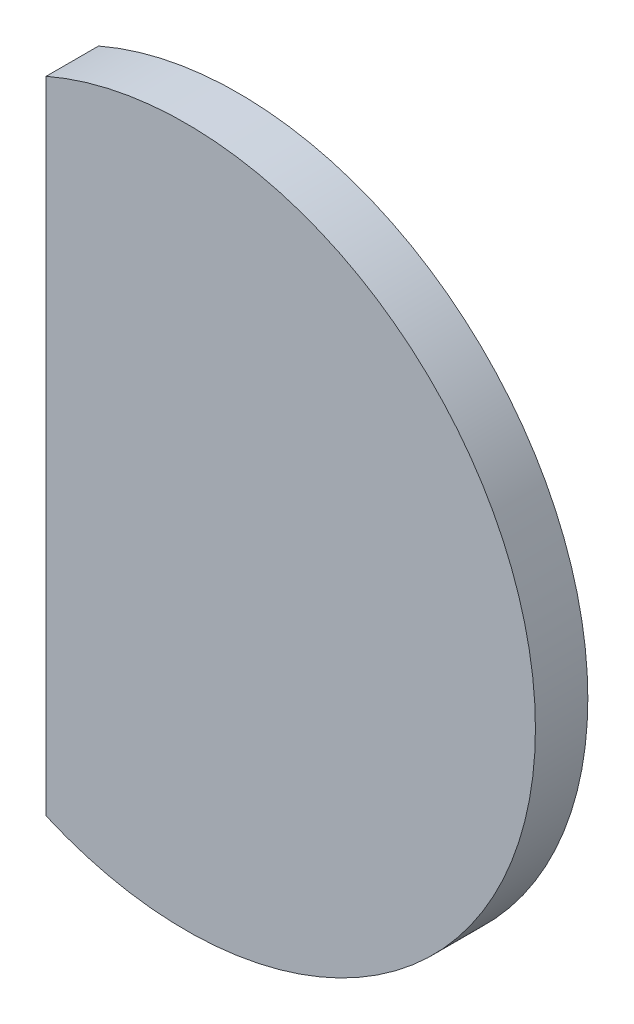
ISO-10303-21;
HEADER;
FILE_DESCRIPTION(('STEP AP214'),'2;1');
FILE_NAME('part.step','',(''),(''),'','','');
FILE_SCHEMA(('AUTOMOTIVE_DESIGN { 1 0 10303 214 1 1 1 1 }'));
ENDSEC;
DATA;
#1=APPLICATION_CONTEXT('core data for automotive mechanical design processes');
#2=APPLICATION_PROTOCOL_DEFINITION('international standard','automotive_design',2000,#1);
#3=PRODUCT_CONTEXT('',#1,'mechanical');
#4=PRODUCT('Part','Part','',(#3));
#5=PRODUCT_RELATED_PRODUCT_CATEGORY('part','',(#4));
#6=PRODUCT_DEFINITION_FORMATION('','',#4);
#7=PRODUCT_DEFINITION_CONTEXT('part definition',#1,'design');
#8=PRODUCT_DEFINITION('design','',#6,#7);
#9=PRODUCT_DEFINITION_SHAPE('','',#8);
#10=(LENGTH_UNIT() NAMED_UNIT(*) SI_UNIT(.MILLI.,.METRE.));
#11=(NAMED_UNIT(*) PLANE_ANGLE_UNIT() SI_UNIT($,.RADIAN.));
#12=(NAMED_UNIT(*) SI_UNIT($,.STERADIAN.) SOLID_ANGLE_UNIT());
#13=UNCERTAINTY_MEASURE_WITH_UNIT(LENGTH_MEASURE(1.E-05),#10,'distance_accuracy_value','');
#14=(GEOMETRIC_REPRESENTATION_CONTEXT(3) GLOBAL_UNCERTAINTY_ASSIGNED_CONTEXT((#13)) GLOBAL_UNIT_ASSIGNED_CONTEXT((#10,
#11,#12)) REPRESENTATION_CONTEXT('',''));
#15=CARTESIAN_POINT('',(0.,0.,0.));
#16=DIRECTION('',(0.,0.,1.));
#17=DIRECTION('',(1.,0.,0.));
#18=AXIS2_PLACEMENT_3D('',#15,#16,#17);
#19=CARTESIAN_POINT('',(0.,0.,15.));
#20=DIRECTION('',(0.,0.,-1.));
#21=DIRECTION('',(-1.,0.,0.));
#22=AXIS2_PLACEMENT_3D('',#19,#20,#21);
#23=CYLINDRICAL_SURFACE('',#22,100.);
#24=CARTESIAN_POINT('',(0.,0.,0.));
#25=DIRECTION('',(0.,0.,1.));
#26=DIRECTION('',(1.,0.,0.));
#27=AXIS2_PLACEMENT_3D('',#24,#25,#26);
#28=CIRCLE('',#27,100.);
#29=CARTESIAN_POINT('',(-40.,-91.6515138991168,0.));
#30=VERTEX_POINT('',#29);
#31=CARTESIAN_POINT('',(-40.,91.6515138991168,0.));
#32=VERTEX_POINT('',#31);
#33=EDGE_CURVE('E64',#30,#32,#28,.T.);
#34=ORIENTED_EDGE('',*,*,#33,.T.);
#35=DIRECTION('',(0.,0.,-1.));
#36=VECTOR('',#35,1.);
#37=CARTESIAN_POINT('',(-40.,91.6515138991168,15.));
#38=LINE('',#37,#36);
#39=CARTESIAN_POINT('',(-40.,91.6515138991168,15.));
#40=VERTEX_POINT('',#39);
#41=EDGE_CURVE('E11',#40,#32,#38,.T.);
#42=ORIENTED_EDGE('',*,*,#41,.F.);
#43=CARTESIAN_POINT('',(0.,0.,15.));
#44=DIRECTION('',(0.,0.,1.));
#45=DIRECTION('',(1.,0.,0.));
#46=AXIS2_PLACEMENT_3D('',#43,#44,#45);
#47=CIRCLE('',#46,100.);
#48=CARTESIAN_POINT('',(-40.,-91.6515138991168,15.));
#49=VERTEX_POINT('',#48);
#50=EDGE_CURVE('E63',#49,#40,#47,.T.);
#51=ORIENTED_EDGE('',*,*,#50,.F.);
#52=DIRECTION('',(0.,0.,-1.));
#53=VECTOR('',#52,1.);
#54=CARTESIAN_POINT('',(-40.,-91.6515138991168,15.));
#55=LINE('',#54,#53);
#56=EDGE_CURVE('E41',#49,#30,#55,.T.);
#57=ORIENTED_EDGE('',*,*,#56,.T.);
#58=EDGE_LOOP('',(#34,#42,#51,#57));
#59=FACE_BOUND('',#58,.T.);
#60=ADVANCED_FACE('F33',(#59),#23,.T.);
#61=CARTESIAN_POINT('',(-40.,91.6515138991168,15.));
#62=DIRECTION('',(1.,0.,0.));
#63=DIRECTION('',(0.,0.,-1.));
#64=AXIS2_PLACEMENT_3D('',#61,#62,#63);
#65=PLANE('',#64);
#66=DIRECTION('',(0.,-1.,0.));
#67=VECTOR('',#66,1.);
#68=CARTESIAN_POINT('',(-40.,91.6515138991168,0.));
#69=LINE('',#68,#67);
#70=EDGE_CURVE('E56',#32,#30,#69,.T.);
#71=ORIENTED_EDGE('',*,*,#70,.T.);
#72=ORIENTED_EDGE('',*,*,#56,.F.);
#73=DIRECTION('',(0.,-1.,0.));
#74=VECTOR('',#73,1.);
#75=CARTESIAN_POINT('',(-40.,91.6515138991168,15.));
#76=LINE('',#75,#74);
#77=EDGE_CURVE('E48',#40,#49,#76,.T.);
#78=ORIENTED_EDGE('',*,*,#77,.F.);
#79=ORIENTED_EDGE('',*,*,#41,.T.);
#80=EDGE_LOOP('',(#71,#72,#78,#79));
#81=FACE_BOUND('',#80,.T.);
#82=ADVANCED_FACE('F59',(#81),#65,.F.);
#83=CARTESIAN_POINT('',(0.,0.,15.));
#84=DIRECTION('',(0.,0.,1.));
#85=DIRECTION('',(1.,0.,0.));
#86=AXIS2_PLACEMENT_3D('',#83,#84,#85);
#87=PLANE('',#86);
#88=ORIENTED_EDGE('',*,*,#50,.T.);
#89=ORIENTED_EDGE('',*,*,#77,.T.);
#90=EDGE_LOOP('',(#88,#89));
#91=FACE_BOUND('',#90,.T.);
#92=ADVANCED_FACE('F71',(#91),#87,.T.);
#93=CARTESIAN_POINT('',(0.,0.,0.));
#94=DIRECTION('',(0.,0.,1.));
#95=DIRECTION('',(1.,0.,0.));
#96=AXIS2_PLACEMENT_3D('',#93,#94,#95);
#97=PLANE('',#96);
#98=ORIENTED_EDGE('',*,*,#33,.F.);
#99=ORIENTED_EDGE('',*,*,#70,.F.);
#100=EDGE_LOOP('',(#98,#99));
#101=FACE_BOUND('',#100,.T.);
#102=ADVANCED_FACE('F67',(#101),#97,.F.);
#103=CLOSED_SHELL('',(#60,#82,#92,#102));
#104=MANIFOLD_SOLID_BREP('B2',#103);
#105=ADVANCED_BREP_SHAPE_REPRESENTATION('',(#18,#104),#14);
#106=SHAPE_DEFINITION_REPRESENTATION(#9,#105);
ENDSEC;
END-ISO-10303-21;
